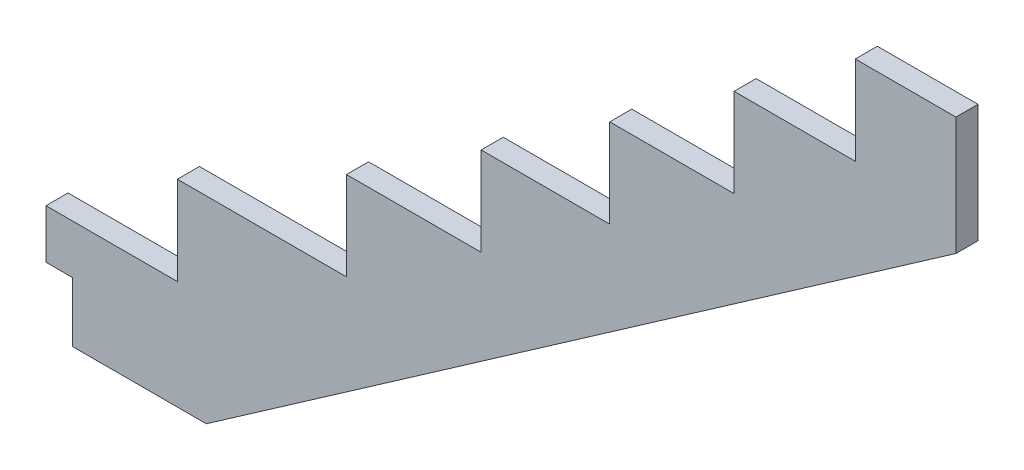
ISO-10303-21;
HEADER;
FILE_DESCRIPTION(('STEP AP214'),'2;1');
FILE_NAME('part.step','',(''),(''),'','','');
FILE_SCHEMA(('AUTOMOTIVE_DESIGN { 1 0 10303 214 1 1 1 1 }'));
ENDSEC;
DATA;
#1=APPLICATION_CONTEXT('core data for automotive mechanical design processes');
#2=APPLICATION_PROTOCOL_DEFINITION('international standard','automotive_design',2000,#1);
#3=PRODUCT_CONTEXT('',#1,'mechanical');
#4=PRODUCT('Part','Part','',(#3));
#5=PRODUCT_RELATED_PRODUCT_CATEGORY('part','',(#4));
#6=PRODUCT_DEFINITION_FORMATION('','',#4);
#7=PRODUCT_DEFINITION_CONTEXT('part definition',#1,'design');
#8=PRODUCT_DEFINITION('design','',#6,#7);
#9=PRODUCT_DEFINITION_SHAPE('','',#8);
#10=(LENGTH_UNIT() NAMED_UNIT(*) SI_UNIT(.MILLI.,.METRE.));
#11=(NAMED_UNIT(*) PLANE_ANGLE_UNIT() SI_UNIT($,.RADIAN.));
#12=(NAMED_UNIT(*) SI_UNIT($,.STERADIAN.) SOLID_ANGLE_UNIT());
#13=UNCERTAINTY_MEASURE_WITH_UNIT(LENGTH_MEASURE(1.E-05),#10,'distance_accuracy_value','');
#14=(GEOMETRIC_REPRESENTATION_CONTEXT(3) GLOBAL_UNCERTAINTY_ASSIGNED_CONTEXT((#13)) GLOBAL_UNIT_ASSIGNED_CONTEXT((#10,
#11,#12)) REPRESENTATION_CONTEXT('',''));
#15=CARTESIAN_POINT('',(0.,0.,0.));
#16=DIRECTION('',(0.,0.,1.));
#17=DIRECTION('',(1.,0.,0.));
#18=AXIS2_PLACEMENT_3D('',#15,#16,#17);
#19=CARTESIAN_POINT('',(-415.807218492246,-891.003911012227,50.));
#20=DIRECTION('',(-0.571638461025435,0.820505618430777,0.));
#21=DIRECTION('',(-0.820505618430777,-0.571638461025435,0.));
#22=AXIS2_PLACEMENT_3D('',#19,#20,#21);
#23=PLANE('',#22);
#24=DIRECTION('',(0.820505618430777,0.571638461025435,0.));
#25=VECTOR('',#24,1.);
#26=CARTESIAN_POINT('',(-415.807218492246,-891.003911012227,0.));
#27=LINE('',#26,#25);
#28=CARTESIAN_POINT('',(-2114.16606425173,-2074.23436678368,0.));
#29=VERTEX_POINT('',#28);
#30=CARTESIAN_POINT('',(-415.807218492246,-891.003911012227,0.));
#31=VERTEX_POINT('',#30);
#32=EDGE_CURVE('E164',#29,#31,#27,.T.);
#33=ORIENTED_EDGE('',*,*,#32,.T.);
#34=DIRECTION('',(0.,0.,-1.));
#35=VECTOR('',#34,1.);
#36=CARTESIAN_POINT('',(-415.807218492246,-891.003911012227,50.));
#37=LINE('',#36,#35);
#38=CARTESIAN_POINT('',(-415.807218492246,-891.003911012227,50.));
#39=VERTEX_POINT('',#38);
#40=EDGE_CURVE('E11',#39,#31,#37,.T.);
#41=ORIENTED_EDGE('',*,*,#40,.F.);
#42=DIRECTION('',(0.820505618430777,0.571638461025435,0.));
#43=VECTOR('',#42,1.);
#44=CARTESIAN_POINT('',(-415.807218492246,-891.003911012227,50.));
#45=LINE('',#44,#43);
#46=CARTESIAN_POINT('',(-2114.16606425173,-2074.23436678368,50.));
#47=VERTEX_POINT('',#46);
#48=EDGE_CURVE('E213',#47,#39,#45,.T.);
#49=ORIENTED_EDGE('',*,*,#48,.F.);
#50=DIRECTION('',(0.,0.,-1.));
#51=VECTOR('',#50,1.);
#52=CARTESIAN_POINT('',(-2114.16606425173,-2074.23436678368,50.));
#53=LINE('',#52,#51);
#54=EDGE_CURVE('E177',#47,#29,#53,.T.);
#55=ORIENTED_EDGE('',*,*,#54,.T.);
#56=EDGE_LOOP('',(#33,#41,#49,#55));
#57=FACE_BOUND('',#56,.T.);
#58=ADVANCED_FACE('F30',(#57),#23,.F.);
#59=CARTESIAN_POINT('',(-415.807218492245,-623.283098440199,50.));
#60=DIRECTION('',(-1.,0.,0.));
#61=DIRECTION('',(0.,-1.,0.));
#62=AXIS2_PLACEMENT_3D('',#59,#60,#61);
#63=PLANE('',#62);
#64=DIRECTION('',(0.,1.,0.));
#65=VECTOR('',#64,1.);
#66=CARTESIAN_POINT('',(-415.807218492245,-623.283098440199,0.));
#67=LINE('',#66,#65);
#68=CARTESIAN_POINT('',(-415.807218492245,-623.283098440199,0.));
#69=VERTEX_POINT('',#68);
#70=EDGE_CURVE('E160',#31,#69,#67,.T.);
#71=ORIENTED_EDGE('',*,*,#70,.T.);
#72=DIRECTION('',(0.,0.,-1.));
#73=VECTOR('',#72,1.);
#74=CARTESIAN_POINT('',(-415.807218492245,-623.283098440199,50.));
#75=LINE('',#74,#73);
#76=CARTESIAN_POINT('',(-415.807218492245,-623.283098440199,50.));
#77=VERTEX_POINT('',#76);
#78=EDGE_CURVE('E37',#77,#69,#75,.T.);
#79=ORIENTED_EDGE('',*,*,#78,.F.);
#80=DIRECTION('',(0.,1.,0.));
#81=VECTOR('',#80,1.);
#82=CARTESIAN_POINT('',(-415.807218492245,-623.283098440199,50.));
#83=LINE('',#82,#81);
#84=EDGE_CURVE('E173',#39,#77,#83,.T.);
#85=ORIENTED_EDGE('',*,*,#84,.F.);
#86=ORIENTED_EDGE('',*,*,#40,.T.);
#87=EDGE_LOOP('',(#71,#79,#85,#86));
#88=FACE_BOUND('',#87,.T.);
#89=ADVANCED_FACE('F172',(#88),#63,.F.);
#90=CARTESIAN_POINT('',(-415.807218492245,-623.283098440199,50.));
#91=DIRECTION('',(0.,-1.,0.));
#92=DIRECTION('',(0.,0.,-1.));
#93=AXIS2_PLACEMENT_3D('',#90,#91,#92);
#94=PLANE('',#93);
#95=DIRECTION('',(-1.,0.,0.));
#96=VECTOR('',#95,1.);
#97=CARTESIAN_POINT('',(-415.807218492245,-623.283098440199,0.));
#98=LINE('',#97,#96);
#99=CARTESIAN_POINT('',(-643.807218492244,-623.283098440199,0.));
#100=VERTEX_POINT('',#99);
#101=EDGE_CURVE('E166',#69,#100,#98,.T.);
#102=ORIENTED_EDGE('',*,*,#101,.T.);
#103=DIRECTION('',(0.,0.,-1.));
#104=VECTOR('',#103,1.);
#105=CARTESIAN_POINT('',(-643.807218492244,-623.283098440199,50.));
#106=LINE('',#105,#104);
#107=CARTESIAN_POINT('',(-643.807218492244,-623.283098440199,50.));
#108=VERTEX_POINT('',#107);
#109=EDGE_CURVE('E294',#108,#100,#106,.T.);
#110=ORIENTED_EDGE('',*,*,#109,.F.);
#111=DIRECTION('',(-1.,0.,0.));
#112=VECTOR('',#111,1.);
#113=CARTESIAN_POINT('',(-415.807218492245,-623.283098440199,50.));
#114=LINE('',#113,#112);
#115=EDGE_CURVE('E216',#77,#108,#114,.T.);
#116=ORIENTED_EDGE('',*,*,#115,.F.);
#117=ORIENTED_EDGE('',*,*,#78,.T.);
#118=EDGE_LOOP('',(#102,#110,#116,#117));
#119=FACE_BOUND('',#118,.T.);
#120=ADVANCED_FACE('F298',(#119),#94,.F.);
#121=CARTESIAN_POINT('',(-643.807218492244,-623.283098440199,50.));
#122=DIRECTION('',(1.,0.,0.));
#123=DIRECTION('',(0.,1.,0.));
#124=AXIS2_PLACEMENT_3D('',#121,#122,#123);
#125=PLANE('',#124);
#126=DIRECTION('',(0.,-1.,0.));
#127=VECTOR('',#126,1.);
#128=CARTESIAN_POINT('',(-643.807218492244,-623.283098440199,0.));
#129=LINE('',#128,#127);
#130=CARTESIAN_POINT('',(-643.807218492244,-824.0530984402,0.));
#131=VERTEX_POINT('',#130);
#132=EDGE_CURVE('E181',#100,#131,#129,.T.);
#133=ORIENTED_EDGE('',*,*,#132,.T.);
#134=DIRECTION('',(0.,0.,-1.));
#135=VECTOR('',#134,1.);
#136=CARTESIAN_POINT('',(-643.807218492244,-824.0530984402,50.));
#137=LINE('',#136,#135);
#138=CARTESIAN_POINT('',(-643.807218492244,-824.0530984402,50.));
#139=VERTEX_POINT('',#138);
#140=EDGE_CURVE('E291',#139,#131,#137,.T.);
#141=ORIENTED_EDGE('',*,*,#140,.F.);
#142=DIRECTION('',(0.,-1.,0.));
#143=VECTOR('',#142,1.);
#144=CARTESIAN_POINT('',(-643.807218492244,-623.283098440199,50.));
#145=LINE('',#144,#143);
#146=EDGE_CURVE('E218',#108,#139,#145,.T.);
#147=ORIENTED_EDGE('',*,*,#146,.F.);
#148=ORIENTED_EDGE('',*,*,#109,.T.);
#149=EDGE_LOOP('',(#133,#141,#147,#148));
#150=FACE_BOUND('',#149,.T.);
#151=ADVANCED_FACE('F306',(#150),#125,.F.);
#152=CARTESIAN_POINT('',(-643.807218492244,-824.0530984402,50.));
#153=DIRECTION('',(0.,-1.,0.));
#154=DIRECTION('',(0.,0.,-1.));
#155=AXIS2_PLACEMENT_3D('',#152,#153,#154);
#156=PLANE('',#155);
#157=DIRECTION('',(-1.,0.,0.));
#158=VECTOR('',#157,1.);
#159=CARTESIAN_POINT('',(-643.807218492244,-824.0530984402,0.));
#160=LINE('',#159,#158);
#161=CARTESIAN_POINT('',(-918.42378780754,-824.0530984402,0.));
#162=VERTEX_POINT('',#161);
#163=EDGE_CURVE('E183',#131,#162,#160,.T.);
#164=ORIENTED_EDGE('',*,*,#163,.T.);
#165=DIRECTION('',(0.,0.,-1.));
#166=VECTOR('',#165,1.);
#167=CARTESIAN_POINT('',(-918.42378780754,-824.0530984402,50.));
#168=LINE('',#167,#166);
#169=CARTESIAN_POINT('',(-918.42378780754,-824.0530984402,50.));
#170=VERTEX_POINT('',#169);
#171=EDGE_CURVE('E288',#170,#162,#168,.T.);
#172=ORIENTED_EDGE('',*,*,#171,.F.);
#173=DIRECTION('',(-1.,0.,0.));
#174=VECTOR('',#173,1.);
#175=CARTESIAN_POINT('',(-643.807218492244,-824.0530984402,50.));
#176=LINE('',#175,#174);
#177=EDGE_CURVE('E220',#139,#170,#176,.T.);
#178=ORIENTED_EDGE('',*,*,#177,.F.);
#179=ORIENTED_EDGE('',*,*,#140,.T.);
#180=EDGE_LOOP('',(#164,#172,#178,#179));
#181=FACE_BOUND('',#180,.T.);
#182=ADVANCED_FACE('F309',(#181),#156,.F.);
#183=CARTESIAN_POINT('',(-918.42378780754,-824.0530984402,50.));
#184=DIRECTION('',(1.,0.,0.));
#185=DIRECTION('',(0.,0.,-1.));
#186=AXIS2_PLACEMENT_3D('',#183,#184,#185);
#187=PLANE('',#186);
#188=DIRECTION('',(0.,-1.,0.));
#189=VECTOR('',#188,1.);
#190=CARTESIAN_POINT('',(-918.42378780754,-824.0530984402,0.));
#191=LINE('',#190,#189);
#192=CARTESIAN_POINT('',(-918.42378780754,-1024.8230984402,0.));
#193=VERTEX_POINT('',#192);
#194=EDGE_CURVE('E185',#162,#193,#191,.T.);
#195=ORIENTED_EDGE('',*,*,#194,.T.);
#196=DIRECTION('',(0.,0.,-1.));
#197=VECTOR('',#196,1.);
#198=CARTESIAN_POINT('',(-918.42378780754,-1024.8230984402,50.));
#199=LINE('',#198,#197);
#200=CARTESIAN_POINT('',(-918.42378780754,-1024.8230984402,50.));
#201=VERTEX_POINT('',#200);
#202=EDGE_CURVE('E285',#201,#193,#199,.T.);
#203=ORIENTED_EDGE('',*,*,#202,.F.);
#204=DIRECTION('',(0.,-1.,0.));
#205=VECTOR('',#204,1.);
#206=CARTESIAN_POINT('',(-918.42378780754,-824.0530984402,50.));
#207=LINE('',#206,#205);
#208=EDGE_CURVE('E222',#170,#201,#207,.T.);
#209=ORIENTED_EDGE('',*,*,#208,.F.);
#210=ORIENTED_EDGE('',*,*,#171,.T.);
#211=EDGE_LOOP('',(#195,#203,#209,#210));
#212=FACE_BOUND('',#211,.T.);
#213=ADVANCED_FACE('F314',(#212),#187,.F.);
#214=CARTESIAN_POINT('',(-918.42378780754,-1024.8230984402,50.));
#215=DIRECTION('',(0.,-1.,0.));
#216=DIRECTION('',(1.,0.,0.));
#217=AXIS2_PLACEMENT_3D('',#214,#215,#216);
#218=PLANE('',#217);
#219=DIRECTION('',(-1.,0.,0.));
#220=VECTOR('',#219,1.);
#221=CARTESIAN_POINT('',(-918.42378780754,-1024.8230984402,0.));
#222=LINE('',#221,#220);
#223=CARTESIAN_POINT('',(-1200.13877587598,-1024.8230984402,0.));
#224=VERTEX_POINT('',#223);
#225=EDGE_CURVE('E187',#193,#224,#222,.T.);
#226=ORIENTED_EDGE('',*,*,#225,.T.);
#227=DIRECTION('',(0.,0.,-1.));
#228=VECTOR('',#227,1.);
#229=CARTESIAN_POINT('',(-1200.13877587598,-1024.8230984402,50.));
#230=LINE('',#229,#228);
#231=CARTESIAN_POINT('',(-1200.13877587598,-1024.8230984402,50.));
#232=VERTEX_POINT('',#231);
#233=EDGE_CURVE('E282',#232,#224,#230,.T.);
#234=ORIENTED_EDGE('',*,*,#233,.F.);
#235=DIRECTION('',(-1.,0.,0.));
#236=VECTOR('',#235,1.);
#237=CARTESIAN_POINT('',(-918.42378780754,-1024.8230984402,50.));
#238=LINE('',#237,#236);
#239=EDGE_CURVE('E224',#201,#232,#238,.T.);
#240=ORIENTED_EDGE('',*,*,#239,.F.);
#241=ORIENTED_EDGE('',*,*,#202,.T.);
#242=EDGE_LOOP('',(#226,#234,#240,#241));
#243=FACE_BOUND('',#242,.T.);
#244=ADVANCED_FACE('F320',(#243),#218,.F.);
#245=CARTESIAN_POINT('',(-1200.13877587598,-1024.8230984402,50.));
#246=DIRECTION('',(1.,0.,0.));
#247=DIRECTION('',(0.,0.,-1.));
#248=AXIS2_PLACEMENT_3D('',#245,#246,#247);
#249=PLANE('',#248);
#250=DIRECTION('',(0.,-1.,0.));
#251=VECTOR('',#250,1.);
#252=CARTESIAN_POINT('',(-1200.13877587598,-1024.8230984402,0.));
#253=LINE('',#252,#251);
#254=CARTESIAN_POINT('',(-1200.13877587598,-1225.5930984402,0.));
#255=VERTEX_POINT('',#254);
#256=EDGE_CURVE('E189',#224,#255,#253,.T.);
#257=ORIENTED_EDGE('',*,*,#256,.T.);
#258=DIRECTION('',(0.,0.,-1.));
#259=VECTOR('',#258,1.);
#260=CARTESIAN_POINT('',(-1200.13877587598,-1225.5930984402,50.));
#261=LINE('',#260,#259);
#262=CARTESIAN_POINT('',(-1200.13877587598,-1225.5930984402,50.));
#263=VERTEX_POINT('',#262);
#264=EDGE_CURVE('E279',#263,#255,#261,.T.);
#265=ORIENTED_EDGE('',*,*,#264,.F.);
#266=DIRECTION('',(0.,-1.,0.));
#267=VECTOR('',#266,1.);
#268=CARTESIAN_POINT('',(-1200.13877587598,-1024.8230984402,50.));
#269=LINE('',#268,#267);
#270=EDGE_CURVE('E226',#232,#263,#269,.T.);
#271=ORIENTED_EDGE('',*,*,#270,.F.);
#272=ORIENTED_EDGE('',*,*,#233,.T.);
#273=EDGE_LOOP('',(#257,#265,#271,#272));
#274=FACE_BOUND('',#273,.T.);
#275=ADVANCED_FACE('F324',(#274),#249,.F.);
#276=CARTESIAN_POINT('',(-1200.13877587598,-1225.5930984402,50.));
#277=DIRECTION('',(0.,-1.,0.));
#278=DIRECTION('',(0.,0.,-1.));
#279=AXIS2_PLACEMENT_3D('',#276,#277,#278);
#280=PLANE('',#279);
#281=DIRECTION('',(-1.,0.,0.));
#282=VECTOR('',#281,1.);
#283=CARTESIAN_POINT('',(-1200.13877587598,-1225.5930984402,0.));
#284=LINE('',#283,#282);
#285=CARTESIAN_POINT('',(-1491.42017944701,-1225.5930984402,0.));
#286=VERTEX_POINT('',#285);
#287=EDGE_CURVE('E191',#255,#286,#284,.T.);
#288=ORIENTED_EDGE('',*,*,#287,.T.);
#289=DIRECTION('',(0.,0.,-1.));
#290=VECTOR('',#289,1.);
#291=CARTESIAN_POINT('',(-1491.42017944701,-1225.5930984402,50.));
#292=LINE('',#291,#290);
#293=CARTESIAN_POINT('',(-1491.42017944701,-1225.5930984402,50.));
#294=VERTEX_POINT('',#293);
#295=EDGE_CURVE('E276',#294,#286,#292,.T.);
#296=ORIENTED_EDGE('',*,*,#295,.F.);
#297=DIRECTION('',(-1.,0.,0.));
#298=VECTOR('',#297,1.);
#299=CARTESIAN_POINT('',(-1200.13877587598,-1225.5930984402,50.));
#300=LINE('',#299,#298);
#301=EDGE_CURVE('E228',#263,#294,#300,.T.);
#302=ORIENTED_EDGE('',*,*,#301,.F.);
#303=ORIENTED_EDGE('',*,*,#264,.T.);
#304=EDGE_LOOP('',(#288,#296,#302,#303));
#305=FACE_BOUND('',#304,.T.);
#306=ADVANCED_FACE('F329',(#305),#280,.F.);
#307=CARTESIAN_POINT('',(-1491.42017944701,-1225.5930984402,50.));
#308=DIRECTION('',(1.,0.,0.));
#309=DIRECTION('',(0.,0.,-1.));
#310=AXIS2_PLACEMENT_3D('',#307,#308,#309);
#311=PLANE('',#310);
#312=DIRECTION('',(0.,-1.,0.));
#313=VECTOR('',#312,1.);
#314=CARTESIAN_POINT('',(-1491.42017944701,-1225.5930984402,0.));
#315=LINE('',#314,#313);
#316=CARTESIAN_POINT('',(-1491.42017944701,-1426.3630984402,0.));
#317=VERTEX_POINT('',#316);
#318=EDGE_CURVE('E193',#286,#317,#315,.T.);
#319=ORIENTED_EDGE('',*,*,#318,.T.);
#320=DIRECTION('',(0.,0.,-1.));
#321=VECTOR('',#320,1.);
#322=CARTESIAN_POINT('',(-1491.42017944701,-1426.3630984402,50.));
#323=LINE('',#322,#321);
#324=CARTESIAN_POINT('',(-1491.42017944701,-1426.3630984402,50.));
#325=VERTEX_POINT('',#324);
#326=EDGE_CURVE('E273',#325,#317,#323,.T.);
#327=ORIENTED_EDGE('',*,*,#326,.F.);
#328=DIRECTION('',(0.,-1.,0.));
#329=VECTOR('',#328,1.);
#330=CARTESIAN_POINT('',(-1491.42017944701,-1225.5930984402,50.));
#331=LINE('',#330,#329);
#332=EDGE_CURVE('E230',#294,#325,#331,.T.);
#333=ORIENTED_EDGE('',*,*,#332,.F.);
#334=ORIENTED_EDGE('',*,*,#295,.T.);
#335=EDGE_LOOP('',(#319,#327,#333,#334));
#336=FACE_BOUND('',#335,.T.);
#337=ADVANCED_FACE('F335',(#336),#311,.F.);
#338=CARTESIAN_POINT('',(-1491.42017944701,-1426.3630984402,50.));
#339=DIRECTION('',(0.,-1.,0.));
#340=DIRECTION('',(0.,0.,-1.));
#341=AXIS2_PLACEMENT_3D('',#338,#339,#340);
#342=PLANE('',#341);
#343=DIRECTION('',(-1.,0.,0.));
#344=VECTOR('',#343,1.);
#345=CARTESIAN_POINT('',(-1491.42017944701,-1426.3630984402,0.));
#346=LINE('',#345,#344);
#347=CARTESIAN_POINT('',(-1796.51421246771,-1426.3630984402,0.));
#348=VERTEX_POINT('',#347);
#349=EDGE_CURVE('E195',#317,#348,#346,.T.);
#350=ORIENTED_EDGE('',*,*,#349,.T.);
#351=DIRECTION('',(0.,0.,-1.));
#352=VECTOR('',#351,1.);
#353=CARTESIAN_POINT('',(-1796.51421246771,-1426.3630984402,50.));
#354=LINE('',#353,#352);
#355=CARTESIAN_POINT('',(-1796.51421246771,-1426.3630984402,50.));
#356=VERTEX_POINT('',#355);
#357=EDGE_CURVE('E270',#356,#348,#354,.T.);
#358=ORIENTED_EDGE('',*,*,#357,.F.);
#359=DIRECTION('',(-1.,0.,0.));
#360=VECTOR('',#359,1.);
#361=CARTESIAN_POINT('',(-1491.42017944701,-1426.3630984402,50.));
#362=LINE('',#361,#360);
#363=EDGE_CURVE('E232',#325,#356,#362,.T.);
#364=ORIENTED_EDGE('',*,*,#363,.F.);
#365=ORIENTED_EDGE('',*,*,#326,.T.);
#366=EDGE_LOOP('',(#350,#358,#364,#365));
#367=FACE_BOUND('',#366,.T.);
#368=ADVANCED_FACE('F339',(#367),#342,.F.);
#369=CARTESIAN_POINT('',(-1796.51421246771,-1426.3630984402,50.));
#370=DIRECTION('',(1.,0.,0.));
#371=DIRECTION('',(0.,0.,-1.));
#372=AXIS2_PLACEMENT_3D('',#369,#370,#371);
#373=PLANE('',#372);
#374=DIRECTION('',(0.,-1.,0.));
#375=VECTOR('',#374,1.);
#376=CARTESIAN_POINT('',(-1796.51421246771,-1426.3630984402,0.));
#377=LINE('',#376,#375);
#378=CARTESIAN_POINT('',(-1796.51421246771,-1627.1330984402,0.));
#379=VERTEX_POINT('',#378);
#380=EDGE_CURVE('E197',#348,#379,#377,.T.);
#381=ORIENTED_EDGE('',*,*,#380,.T.);
#382=DIRECTION('',(0.,0.,-1.));
#383=VECTOR('',#382,1.);
#384=CARTESIAN_POINT('',(-1796.51421246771,-1627.1330984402,50.));
#385=LINE('',#384,#383);
#386=CARTESIAN_POINT('',(-1796.51421246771,-1627.1330984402,50.));
#387=VERTEX_POINT('',#386);
#388=EDGE_CURVE('E267',#387,#379,#385,.T.);
#389=ORIENTED_EDGE('',*,*,#388,.F.);
#390=DIRECTION('',(0.,-1.,0.));
#391=VECTOR('',#390,1.);
#392=CARTESIAN_POINT('',(-1796.51421246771,-1426.3630984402,50.));
#393=LINE('',#392,#391);
#394=EDGE_CURVE('E234',#356,#387,#393,.T.);
#395=ORIENTED_EDGE('',*,*,#394,.F.);
#396=ORIENTED_EDGE('',*,*,#357,.T.);
#397=EDGE_LOOP('',(#381,#389,#395,#396));
#398=FACE_BOUND('',#397,.T.);
#399=ADVANCED_FACE('F344',(#398),#373,.F.);
#400=CARTESIAN_POINT('',(-1796.51421246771,-1627.1330984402,50.));
#401=DIRECTION('',(0.,-1.,0.));
#402=DIRECTION('',(0.,0.,-1.));
#403=AXIS2_PLACEMENT_3D('',#400,#401,#402);
#404=PLANE('',#403);
#405=DIRECTION('',(-1.,0.,0.));
#406=VECTOR('',#405,1.);
#407=CARTESIAN_POINT('',(-1796.51421246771,-1627.1330984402,0.));
#408=LINE('',#407,#406);
#409=CARTESIAN_POINT('',(-2179.63659001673,-1627.1330984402,0.));
#410=VERTEX_POINT('',#409);
#411=EDGE_CURVE('E199',#379,#410,#408,.T.);
#412=ORIENTED_EDGE('',*,*,#411,.T.);
#413=DIRECTION('',(0.,0.,-1.));
#414=VECTOR('',#413,1.);
#415=CARTESIAN_POINT('',(-2179.63659001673,-1627.1330984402,50.));
#416=LINE('',#415,#414);
#417=CARTESIAN_POINT('',(-2179.63659001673,-1627.1330984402,50.));
#418=VERTEX_POINT('',#417);
#419=EDGE_CURVE('E264',#418,#410,#416,.T.);
#420=ORIENTED_EDGE('',*,*,#419,.F.);
#421=DIRECTION('',(-1.,0.,0.));
#422=VECTOR('',#421,1.);
#423=CARTESIAN_POINT('',(-1796.51421246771,-1627.1330984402,50.));
#424=LINE('',#423,#422);
#425=EDGE_CURVE('E236',#387,#418,#424,.T.);
#426=ORIENTED_EDGE('',*,*,#425,.F.);
#427=ORIENTED_EDGE('',*,*,#388,.T.);
#428=EDGE_LOOP('',(#412,#420,#426,#427));
#429=FACE_BOUND('',#428,.T.);
#430=ADVANCED_FACE('F350',(#429),#404,.F.);
#431=CARTESIAN_POINT('',(-2179.63659001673,-1627.1330984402,50.));
#432=DIRECTION('',(1.,0.,0.));
#433=DIRECTION('',(0.,1.,0.));
#434=AXIS2_PLACEMENT_3D('',#431,#432,#433);
#435=PLANE('',#434);
#436=DIRECTION('',(0.,-1.,0.));
#437=VECTOR('',#436,1.);
#438=CARTESIAN_POINT('',(-2179.63659001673,-1627.1330984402,0.));
#439=LINE('',#438,#437);
#440=CARTESIAN_POINT('',(-2179.63659001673,-1827.9030984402,0.));
#441=VERTEX_POINT('',#440);
#442=EDGE_CURVE('E201',#410,#441,#439,.T.);
#443=ORIENTED_EDGE('',*,*,#442,.T.);
#444=DIRECTION('',(0.,0.,-1.));
#445=VECTOR('',#444,1.);
#446=CARTESIAN_POINT('',(-2179.63659001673,-1827.9030984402,50.));
#447=LINE('',#446,#445);
#448=CARTESIAN_POINT('',(-2179.63659001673,-1827.9030984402,50.));
#449=VERTEX_POINT('',#448);
#450=EDGE_CURVE('E261',#449,#441,#447,.T.);
#451=ORIENTED_EDGE('',*,*,#450,.F.);
#452=DIRECTION('',(0.,-1.,0.));
#453=VECTOR('',#452,1.);
#454=CARTESIAN_POINT('',(-2179.63659001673,-1627.1330984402,50.));
#455=LINE('',#454,#453);
#456=EDGE_CURVE('E238',#418,#449,#455,.T.);
#457=ORIENTED_EDGE('',*,*,#456,.F.);
#458=ORIENTED_EDGE('',*,*,#419,.T.);
#459=EDGE_LOOP('',(#443,#451,#457,#458));
#460=FACE_BOUND('',#459,.T.);
#461=ADVANCED_FACE('F354',(#460),#435,.F.);
#462=CARTESIAN_POINT('',(-2179.63659001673,-1827.9030984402,50.));
#463=DIRECTION('',(0.,-1.,0.));
#464=DIRECTION('',(1.,0.,0.));
#465=AXIS2_PLACEMENT_3D('',#462,#463,#464);
#466=PLANE('',#465);
#467=DIRECTION('',(-1.,0.,0.));
#468=VECTOR('',#467,1.);
#469=CARTESIAN_POINT('',(-2179.63659001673,-1827.9030984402,0.));
#470=LINE('',#469,#468);
#471=CARTESIAN_POINT('',(-2477.26797581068,-1827.9030984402,0.));
#472=VERTEX_POINT('',#471);
#473=EDGE_CURVE('E203',#441,#472,#470,.T.);
#474=ORIENTED_EDGE('',*,*,#473,.T.);
#475=DIRECTION('',(0.,0.,-1.));
#476=VECTOR('',#475,1.);
#477=CARTESIAN_POINT('',(-2477.26797581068,-1827.9030984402,50.));
#478=LINE('',#477,#476);
#479=CARTESIAN_POINT('',(-2477.26797581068,-1827.9030984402,50.));
#480=VERTEX_POINT('',#479);
#481=EDGE_CURVE('E258',#480,#472,#478,.T.);
#482=ORIENTED_EDGE('',*,*,#481,.F.);
#483=DIRECTION('',(-1.,0.,0.));
#484=VECTOR('',#483,1.);
#485=CARTESIAN_POINT('',(-2179.63659001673,-1827.9030984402,50.));
#486=LINE('',#485,#484);
#487=EDGE_CURVE('E240',#449,#480,#486,.T.);
#488=ORIENTED_EDGE('',*,*,#487,.F.);
#489=ORIENTED_EDGE('',*,*,#450,.T.);
#490=EDGE_LOOP('',(#474,#482,#488,#489));
#491=FACE_BOUND('',#490,.T.);
#492=ADVANCED_FACE('F359',(#491),#466,.F.);
#493=CARTESIAN_POINT('',(-2477.26797581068,-1827.9030984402,50.));
#494=DIRECTION('',(1.,0.,0.));
#495=DIRECTION('',(0.,0.,-1.));
#496=AXIS2_PLACEMENT_3D('',#493,#494,#495);
#497=PLANE('',#496);
#498=DIRECTION('',(0.,-1.,0.));
#499=VECTOR('',#498,1.);
#500=CARTESIAN_POINT('',(-2477.26797581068,-1827.9030984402,0.));
#501=LINE('',#500,#499);
#502=CARTESIAN_POINT('',(-2477.26797581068,-1938.9030984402,0.));
#503=VERTEX_POINT('',#502);
#504=EDGE_CURVE('E205',#472,#503,#501,.T.);
#505=ORIENTED_EDGE('',*,*,#504,.T.);
#506=DIRECTION('',(0.,0.,-1.));
#507=VECTOR('',#506,1.);
#508=CARTESIAN_POINT('',(-2477.26797581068,-1938.9030984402,50.));
#509=LINE('',#508,#507);
#510=CARTESIAN_POINT('',(-2477.26797581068,-1938.9030984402,50.));
#511=VERTEX_POINT('',#510);
#512=EDGE_CURVE('E255',#511,#503,#509,.T.);
#513=ORIENTED_EDGE('',*,*,#512,.F.);
#514=DIRECTION('',(0.,-1.,0.));
#515=VECTOR('',#514,1.);
#516=CARTESIAN_POINT('',(-2477.26797581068,-1827.9030984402,50.));
#517=LINE('',#516,#515);
#518=EDGE_CURVE('E242',#480,#511,#517,.T.);
#519=ORIENTED_EDGE('',*,*,#518,.F.);
#520=ORIENTED_EDGE('',*,*,#481,.T.);
#521=EDGE_LOOP('',(#505,#513,#519,#520));
#522=FACE_BOUND('',#521,.T.);
#523=ADVANCED_FACE('F365',(#522),#497,.F.);
#524=CARTESIAN_POINT('',(-2477.26797581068,-1938.9030984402,50.));
#525=DIRECTION('',(0.,1.,0.));
#526=DIRECTION('',(0.,0.,1.));
#527=AXIS2_PLACEMENT_3D('',#524,#525,#526);
#528=PLANE('',#527);
#529=DIRECTION('',(1.,0.,0.));
#530=VECTOR('',#529,1.);
#531=CARTESIAN_POINT('',(-2477.26797581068,-1938.9030984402,0.));
#532=LINE('',#531,#530);
#533=CARTESIAN_POINT('',(-2417.26797581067,-1938.9030984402,0.));
#534=VERTEX_POINT('',#533);
#535=EDGE_CURVE('E207',#503,#534,#532,.T.);
#536=ORIENTED_EDGE('',*,*,#535,.T.);
#537=DIRECTION('',(0.,0.,-1.));
#538=VECTOR('',#537,1.);
#539=CARTESIAN_POINT('',(-2417.26797581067,-1938.9030984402,50.));
#540=LINE('',#539,#538);
#541=CARTESIAN_POINT('',(-2417.26797581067,-1938.9030984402,50.));
#542=VERTEX_POINT('',#541);
#543=EDGE_CURVE('E252',#542,#534,#540,.T.);
#544=ORIENTED_EDGE('',*,*,#543,.F.);
#545=DIRECTION('',(1.,0.,0.));
#546=VECTOR('',#545,1.);
#547=CARTESIAN_POINT('',(-2477.26797581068,-1938.9030984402,50.));
#548=LINE('',#547,#546);
#549=EDGE_CURVE('E244',#511,#542,#548,.T.);
#550=ORIENTED_EDGE('',*,*,#549,.F.);
#551=ORIENTED_EDGE('',*,*,#512,.T.);
#552=EDGE_LOOP('',(#536,#544,#550,#551));
#553=FACE_BOUND('',#552,.T.);
#554=ADVANCED_FACE('F369',(#553),#528,.F.);
#555=CARTESIAN_POINT('',(-2417.26797581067,-1938.9030984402,50.));
#556=DIRECTION('',(1.,0.,0.));
#557=DIRECTION('',(0.,0.,-1.));
#558=AXIS2_PLACEMENT_3D('',#555,#556,#557);
#559=PLANE('',#558);
#560=DIRECTION('',(0.,-1.,0.));
#561=VECTOR('',#560,1.);
#562=CARTESIAN_POINT('',(-2417.26797581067,-1938.9030984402,0.));
#563=LINE('',#562,#561);
#564=CARTESIAN_POINT('',(-2417.26797581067,-2074.23436678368,0.));
#565=VERTEX_POINT('',#564);
#566=EDGE_CURVE('E209',#534,#565,#563,.T.);
#567=ORIENTED_EDGE('',*,*,#566,.T.);
#568=DIRECTION('',(0.,0.,-1.));
#569=VECTOR('',#568,1.);
#570=CARTESIAN_POINT('',(-2417.26797581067,-2074.23436678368,50.));
#571=LINE('',#570,#569);
#572=CARTESIAN_POINT('',(-2417.26797581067,-2074.23436678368,50.));
#573=VERTEX_POINT('',#572);
#574=EDGE_CURVE('E249',#573,#565,#571,.T.);
#575=ORIENTED_EDGE('',*,*,#574,.F.);
#576=DIRECTION('',(0.,-1.,0.));
#577=VECTOR('',#576,1.);
#578=CARTESIAN_POINT('',(-2417.26797581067,-1938.9030984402,50.));
#579=LINE('',#578,#577);
#580=EDGE_CURVE('E49',#542,#573,#579,.T.);
#581=ORIENTED_EDGE('',*,*,#580,.F.);
#582=ORIENTED_EDGE('',*,*,#543,.T.);
#583=EDGE_LOOP('',(#567,#575,#581,#582));
#584=FACE_BOUND('',#583,.T.);
#585=ADVANCED_FACE('F372',(#584),#559,.F.);
#586=CARTESIAN_POINT('',(-2114.16606425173,-2074.23436678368,50.));
#587=DIRECTION('',(0.,1.,0.));
#588=DIRECTION('',(0.,0.,1.));
#589=AXIS2_PLACEMENT_3D('',#586,#587,#588);
#590=PLANE('',#589);
#591=DIRECTION('',(1.,0.,0.));
#592=VECTOR('',#591,1.);
#593=CARTESIAN_POINT('',(-2114.16606425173,-2074.23436678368,0.));
#594=LINE('',#593,#592);
#595=EDGE_CURVE('E211',#565,#29,#594,.T.);
#596=ORIENTED_EDGE('',*,*,#595,.T.);
#597=ORIENTED_EDGE('',*,*,#54,.F.);
#598=DIRECTION('',(1.,0.,0.));
#599=VECTOR('',#598,1.);
#600=CARTESIAN_POINT('',(-2114.16606425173,-2074.23436678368,50.));
#601=LINE('',#600,#599);
#602=EDGE_CURVE('E44',#573,#47,#601,.T.);
#603=ORIENTED_EDGE('',*,*,#602,.F.);
#604=ORIENTED_EDGE('',*,*,#574,.T.);
#605=EDGE_LOOP('',(#596,#597,#603,#604));
#606=FACE_BOUND('',#605,.T.);
#607=ADVANCED_FACE('F374',(#606),#590,.F.);
#608=CARTESIAN_POINT('',(-2179.63659001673,-2119.84705943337,50.));
#609=DIRECTION('',(0.,0.,1.));
#610=DIRECTION('',(1.,0.,0.));
#611=AXIS2_PLACEMENT_3D('',#608,#609,#610);
#612=PLANE('',#611);
#613=ORIENTED_EDGE('',*,*,#48,.T.);
#614=ORIENTED_EDGE('',*,*,#84,.T.);
#615=ORIENTED_EDGE('',*,*,#115,.T.);
#616=ORIENTED_EDGE('',*,*,#146,.T.);
#617=ORIENTED_EDGE('',*,*,#177,.T.);
#618=ORIENTED_EDGE('',*,*,#208,.T.);
#619=ORIENTED_EDGE('',*,*,#239,.T.);
#620=ORIENTED_EDGE('',*,*,#270,.T.);
#621=ORIENTED_EDGE('',*,*,#301,.T.);
#622=ORIENTED_EDGE('',*,*,#332,.T.);
#623=ORIENTED_EDGE('',*,*,#363,.T.);
#624=ORIENTED_EDGE('',*,*,#394,.T.);
#625=ORIENTED_EDGE('',*,*,#425,.T.);
#626=ORIENTED_EDGE('',*,*,#456,.T.);
#627=ORIENTED_EDGE('',*,*,#487,.T.);
#628=ORIENTED_EDGE('',*,*,#518,.T.);
#629=ORIENTED_EDGE('',*,*,#549,.T.);
#630=ORIENTED_EDGE('',*,*,#580,.T.);
#631=ORIENTED_EDGE('',*,*,#602,.T.);
#632=EDGE_LOOP('',(#613,#614,#615,#616,#617,#618,#619,#620,#621,#622,#623,#624,#625,#626,#627,
#628,#629,#630,#631));
#633=FACE_BOUND('',#632,.T.);
#634=ADVANCED_FACE('F301',(#633),#612,.T.);
#635=CARTESIAN_POINT('',(-2179.63659001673,-2119.84705943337,0.));
#636=DIRECTION('',(0.,0.,1.));
#637=DIRECTION('',(1.,0.,0.));
#638=AXIS2_PLACEMENT_3D('',#635,#636,#637);
#639=PLANE('',#638);
#640=ORIENTED_EDGE('',*,*,#32,.F.);
#641=ORIENTED_EDGE('',*,*,#595,.F.);
#642=ORIENTED_EDGE('',*,*,#566,.F.);
#643=ORIENTED_EDGE('',*,*,#535,.F.);
#644=ORIENTED_EDGE('',*,*,#504,.F.);
#645=ORIENTED_EDGE('',*,*,#473,.F.);
#646=ORIENTED_EDGE('',*,*,#442,.F.);
#647=ORIENTED_EDGE('',*,*,#411,.F.);
#648=ORIENTED_EDGE('',*,*,#380,.F.);
#649=ORIENTED_EDGE('',*,*,#349,.F.);
#650=ORIENTED_EDGE('',*,*,#318,.F.);
#651=ORIENTED_EDGE('',*,*,#287,.F.);
#652=ORIENTED_EDGE('',*,*,#256,.F.);
#653=ORIENTED_EDGE('',*,*,#225,.F.);
#654=ORIENTED_EDGE('',*,*,#194,.F.);
#655=ORIENTED_EDGE('',*,*,#163,.F.);
#656=ORIENTED_EDGE('',*,*,#132,.F.);
#657=ORIENTED_EDGE('',*,*,#101,.F.);
#658=ORIENTED_EDGE('',*,*,#70,.F.);
#659=EDGE_LOOP('',(#640,#641,#642,#643,#644,#645,#646,#647,#648,#649,#650,#651,#652,#653,#654,
#655,#656,#657,#658));
#660=FACE_BOUND('',#659,.T.);
#661=ADVANCED_FACE('F161',(#660),#639,.F.);
#662=CLOSED_SHELL('',(#58,#89,#120,#151,#182,#213,#244,#275,#306,#337,#368,#399,#430,#461,#492,
#523,#554,#585,#607,#634,#661));
#663=MANIFOLD_SOLID_BREP('B2',#662);
#664=ADVANCED_BREP_SHAPE_REPRESENTATION('',(#18,#663),#14);
#665=SHAPE_DEFINITION_REPRESENTATION(#9,#664);
ENDSEC;
END-ISO-10303-21;
